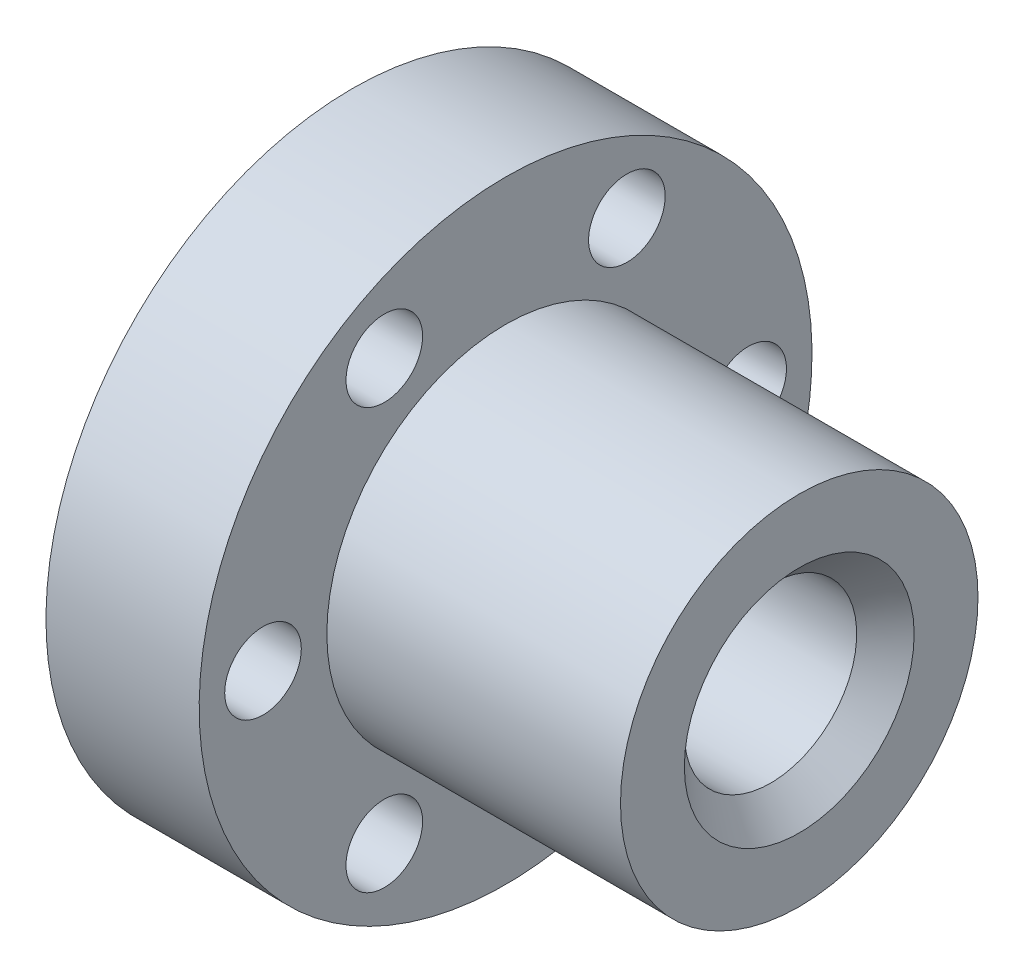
ISO-10303-21;
HEADER;
FILE_DESCRIPTION(('STEP AP214'),'2;1');
FILE_NAME('part.step','',(''),(''),'','','');
FILE_SCHEMA(('AUTOMOTIVE_DESIGN { 1 0 10303 214 1 1 1 1 }'));
ENDSEC;
DATA;
#1=APPLICATION_CONTEXT('core data for automotive mechanical design processes');
#2=APPLICATION_PROTOCOL_DEFINITION('international standard','automotive_design',2000,#1);
#3=PRODUCT_CONTEXT('',#1,'mechanical');
#4=PRODUCT('Part','Part','',(#3));
#5=PRODUCT_RELATED_PRODUCT_CATEGORY('part','',(#4));
#6=PRODUCT_DEFINITION_FORMATION('','',#4);
#7=PRODUCT_DEFINITION_CONTEXT('part definition',#1,'design');
#8=PRODUCT_DEFINITION('design','',#6,#7);
#9=PRODUCT_DEFINITION_SHAPE('','',#8);
#10=(LENGTH_UNIT() NAMED_UNIT(*) SI_UNIT(.MILLI.,.METRE.));
#11=(NAMED_UNIT(*) PLANE_ANGLE_UNIT() SI_UNIT($,.RADIAN.));
#12=(NAMED_UNIT(*) SI_UNIT($,.STERADIAN.) SOLID_ANGLE_UNIT());
#13=UNCERTAINTY_MEASURE_WITH_UNIT(LENGTH_MEASURE(1.E-05),#10,'distance_accuracy_value','');
#14=(GEOMETRIC_REPRESENTATION_CONTEXT(3) GLOBAL_UNCERTAINTY_ASSIGNED_CONTEXT((#13)) GLOBAL_UNIT_ASSIGNED_CONTEXT((#10,
#11,#12)) REPRESENTATION_CONTEXT('',''));
#15=CARTESIAN_POINT('',(0.,0.,0.));
#16=DIRECTION('',(0.,0.,1.));
#17=DIRECTION('',(1.,0.,0.));
#18=AXIS2_PLACEMENT_3D('',#15,#16,#17);
#19=CARTESIAN_POINT('',(23.,0.,0.));
#20=DIRECTION('',(1.,0.,0.));
#21=DIRECTION('',(0.,0.,-1.));
#22=AXIS2_PLACEMENT_3D('',#19,#20,#21);
#23=PLANE('',#22);
#24=CARTESIAN_POINT('',(23.,0.,0.));
#25=DIRECTION('',(-1.,0.,0.));
#26=DIRECTION('',(0.,-1.,0.));
#27=AXIS2_PLACEMENT_3D('',#24,#25,#26);
#28=CIRCLE('',#27,14.);
#29=CARTESIAN_POINT('',(23.,-14.,0.));
#30=VERTEX_POINT('',#29);
#31=EDGE_CURVE('E23',#30,#30,#28,.T.);
#32=ORIENTED_EDGE('',*,*,#31,.F.);
#33=EDGE_LOOP('',(#32));
#34=FACE_BOUND('',#33,.T.);
#35=CARTESIAN_POINT('',(23.,0.,0.));
#36=DIRECTION('',(-1.,0.,0.));
#37=DIRECTION('',(0.,0.,1.));
#38=AXIS2_PLACEMENT_3D('',#35,#36,#37);
#39=CIRCLE('',#38,9.);
#40=CARTESIAN_POINT('',(23.,0.,9.00000000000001));
#41=VERTEX_POINT('',#40);
#42=EDGE_CURVE('E76',#41,#41,#39,.T.);
#43=ORIENTED_EDGE('',*,*,#42,.T.);
#44=EDGE_LOOP('',(#43));
#45=FACE_BOUND('',#44,.T.);
#46=ADVANCED_FACE('F14',(#34,#45),#23,.T.);
#47=CARTESIAN_POINT('',(-12.,0.,0.));
#48=DIRECTION('',(-1.,0.,0.));
#49=DIRECTION('',(0.,0.,1.));
#50=AXIS2_PLACEMENT_3D('',#47,#48,#49);
#51=PLANE('',#50);
#52=CARTESIAN_POINT('',(-12.,0.,0.));
#53=DIRECTION('',(1.,0.,0.));
#54=DIRECTION('',(0.,1.,0.));
#55=AXIS2_PLACEMENT_3D('',#52,#53,#54);
#56=CIRCLE('',#55,24.);
#57=CARTESIAN_POINT('',(-12.,24.,0.));
#58=VERTEX_POINT('',#57);
#59=EDGE_CURVE('E33',#58,#58,#56,.T.);
#60=ORIENTED_EDGE('',*,*,#59,.F.);
#61=EDGE_LOOP('',(#60));
#62=FACE_BOUND('',#61,.T.);
#63=CARTESIAN_POINT('',(-11.9999999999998,0.,19.));
#64=DIRECTION('',(-1.,0.,0.));
#65=DIRECTION('',(0.,0.,1.));
#66=AXIS2_PLACEMENT_3D('',#63,#64,#65);
#67=CIRCLE('',#66,3.);
#68=CARTESIAN_POINT('',(-11.9999999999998,0.,22.));
#69=VERTEX_POINT('',#68);
#70=EDGE_CURVE('E41',#69,#69,#67,.T.);
#71=ORIENTED_EDGE('',*,*,#70,.F.);
#72=EDGE_LOOP('',(#71));
#73=FACE_BOUND('',#72,.T.);
#74=CARTESIAN_POINT('',(-11.9999999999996,-16.4544826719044,9.50000000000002));
#75=DIRECTION('',(-1.,0.,0.));
#76=DIRECTION('',(0.,0.,1.));
#77=AXIS2_PLACEMENT_3D('',#74,#75,#76);
#78=CIRCLE('',#77,3.);
#79=CARTESIAN_POINT('',(-11.9999999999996,-16.4544826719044,12.5));
#80=VERTEX_POINT('',#79);
#81=EDGE_CURVE('E42',#80,#80,#78,.T.);
#82=ORIENTED_EDGE('',*,*,#81,.F.);
#83=EDGE_LOOP('',(#82));
#84=FACE_BOUND('',#83,.T.);
#85=CARTESIAN_POINT('',(-11.9999999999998,-16.4544826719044,-9.50000000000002));
#86=DIRECTION('',(-1.,0.,0.));
#87=DIRECTION('',(0.,0.,1.));
#88=AXIS2_PLACEMENT_3D('',#85,#86,#87);
#89=CIRCLE('',#88,3.);
#90=CARTESIAN_POINT('',(-11.9999999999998,-16.4544826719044,-6.50000000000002));
#91=VERTEX_POINT('',#90);
#92=EDGE_CURVE('E47',#91,#91,#89,.T.);
#93=ORIENTED_EDGE('',*,*,#92,.F.);
#94=EDGE_LOOP('',(#93));
#95=FACE_BOUND('',#94,.T.);
#96=CARTESIAN_POINT('',(-12.,0.,-19.));
#97=DIRECTION('',(-1.,0.,0.));
#98=DIRECTION('',(0.,0.,1.));
#99=AXIS2_PLACEMENT_3D('',#96,#97,#98);
#100=CIRCLE('',#99,3.);
#101=CARTESIAN_POINT('',(-12.,0.,-16.));
#102=VERTEX_POINT('',#101);
#103=EDGE_CURVE('E52',#102,#102,#100,.T.);
#104=ORIENTED_EDGE('',*,*,#103,.F.);
#105=EDGE_LOOP('',(#104));
#106=FACE_BOUND('',#105,.T.);
#107=CARTESIAN_POINT('',(-12.,16.4544826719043,-9.50000000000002));
#108=DIRECTION('',(-1.,0.,0.));
#109=DIRECTION('',(0.,0.,1.));
#110=AXIS2_PLACEMENT_3D('',#107,#108,#109);
#111=CIRCLE('',#110,3.);
#112=CARTESIAN_POINT('',(-12.,16.4544826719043,-6.50000000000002));
#113=VERTEX_POINT('',#112);
#114=EDGE_CURVE('E56',#113,#113,#111,.T.);
#115=ORIENTED_EDGE('',*,*,#114,.F.);
#116=EDGE_LOOP('',(#115));
#117=FACE_BOUND('',#116,.T.);
#118=CARTESIAN_POINT('',(-11.9999999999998,16.4544826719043,9.50000000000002));
#119=DIRECTION('',(-1.,0.,0.));
#120=DIRECTION('',(0.,0.,1.));
#121=AXIS2_PLACEMENT_3D('',#118,#119,#120);
#122=CIRCLE('',#121,3.);
#123=CARTESIAN_POINT('',(-11.9999999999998,16.4544826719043,12.5));
#124=VERTEX_POINT('',#123);
#125=EDGE_CURVE('E60',#124,#124,#122,.T.);
#126=ORIENTED_EDGE('',*,*,#125,.F.);
#127=EDGE_LOOP('',(#126));
#128=FACE_BOUND('',#127,.T.);
#129=CARTESIAN_POINT('',(-12.,0.,0.));
#130=DIRECTION('',(-1.,0.,0.));
#131=DIRECTION('',(0.,0.,1.));
#132=AXIS2_PLACEMENT_3D('',#129,#130,#131);
#133=CIRCLE('',#132,9.);
#134=CARTESIAN_POINT('',(-12.,0.,9.00000000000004));
#135=VERTEX_POINT('',#134);
#136=EDGE_CURVE('E121',#135,#135,#133,.T.);
#137=ORIENTED_EDGE('',*,*,#136,.F.);
#138=EDGE_LOOP('',(#137));
#139=FACE_BOUND('',#138,.T.);
#140=ADVANCED_FACE('F104',(#62,#73,#84,#95,#106,#117,#128,#139),#51,.T.);
#141=CARTESIAN_POINT('',(-1.,0.,0.));
#142=DIRECTION('',(1.,0.,0.));
#143=DIRECTION('',(0.,-1.,0.));
#144=AXIS2_PLACEMENT_3D('',#141,#142,#143);
#145=CYLINDRICAL_SURFACE('',#144,14.);
#146=CARTESIAN_POINT('',(0.,0.,0.));
#147=DIRECTION('',(1.,0.,0.));
#148=DIRECTION('',(0.,0.,-1.));
#149=AXIS2_PLACEMENT_3D('',#146,#147,#148);
#150=CIRCLE('',#149,14.);
#151=CARTESIAN_POINT('',(0.,0.,-14.));
#152=VERTEX_POINT('',#151);
#153=EDGE_CURVE('E10',#152,#152,#150,.F.);
#154=ORIENTED_EDGE('',*,*,#153,.F.);
#155=EDGE_LOOP('',(#154));
#156=FACE_BOUND('',#155,.T.);
#157=ORIENTED_EDGE('',*,*,#31,.T.);
#158=EDGE_LOOP('',(#157));
#159=FACE_BOUND('',#158,.T.);
#160=ADVANCED_FACE('F16',(#156,#159),#145,.T.);
#161=CARTESIAN_POINT('',(0.,0.,0.));
#162=DIRECTION('',(1.,0.,0.));
#163=DIRECTION('',(0.,0.,-1.));
#164=AXIS2_PLACEMENT_3D('',#161,#162,#163);
#165=PLANE('',#164);
#166=CARTESIAN_POINT('',(2.22044604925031E-13,16.4544826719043,9.50000000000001));
#167=DIRECTION('',(1.,0.,0.));
#168=DIRECTION('',(0.,0.,-1.));
#169=AXIS2_PLACEMENT_3D('',#166,#167,#168);
#170=CIRCLE('',#169,3.);
#171=CARTESIAN_POINT('',(2.22044604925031E-13,16.4544826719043,6.50000000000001));
#172=VERTEX_POINT('',#171);
#173=EDGE_CURVE('E18',#172,#172,#170,.T.);
#174=ORIENTED_EDGE('',*,*,#173,.F.);
#175=EDGE_LOOP('',(#174));
#176=FACE_BOUND('',#175,.T.);
#177=CARTESIAN_POINT('',(0.,16.4544826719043,-9.50000000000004));
#178=DIRECTION('',(1.,0.,0.));
#179=DIRECTION('',(0.,0.,-1.));
#180=AXIS2_PLACEMENT_3D('',#177,#178,#179);
#181=CIRCLE('',#180,3.);
#182=CARTESIAN_POINT('',(0.,16.4544826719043,-12.5));
#183=VERTEX_POINT('',#182);
#184=EDGE_CURVE('E57',#183,#183,#181,.T.);
#185=ORIENTED_EDGE('',*,*,#184,.F.);
#186=EDGE_LOOP('',(#185));
#187=FACE_BOUND('',#186,.T.);
#188=CARTESIAN_POINT('',(0.,0.,-19.));
#189=DIRECTION('',(1.,0.,0.));
#190=DIRECTION('',(0.,0.,-1.));
#191=AXIS2_PLACEMENT_3D('',#188,#189,#190);
#192=CIRCLE('',#191,3.);
#193=CARTESIAN_POINT('',(0.,0.,-22.));
#194=VERTEX_POINT('',#193);
#195=EDGE_CURVE('E53',#194,#194,#192,.T.);
#196=ORIENTED_EDGE('',*,*,#195,.F.);
#197=EDGE_LOOP('',(#196));
#198=FACE_BOUND('',#197,.T.);
#199=CARTESIAN_POINT('',(2.22044604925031E-13,-16.4544826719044,-9.50000000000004));
#200=DIRECTION('',(1.,0.,0.));
#201=DIRECTION('',(0.,0.,-1.));
#202=AXIS2_PLACEMENT_3D('',#199,#200,#201);
#203=CIRCLE('',#202,3.);
#204=CARTESIAN_POINT('',(2.22044604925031E-13,-16.4544826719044,-12.5));
#205=VERTEX_POINT('',#204);
#206=EDGE_CURVE('E48',#205,#205,#203,.T.);
#207=ORIENTED_EDGE('',*,*,#206,.F.);
#208=EDGE_LOOP('',(#207));
#209=FACE_BOUND('',#208,.T.);
#210=CARTESIAN_POINT('',(4.44089209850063E-13,-16.4544826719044,9.50000000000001));
#211=DIRECTION('',(1.,0.,0.));
#212=DIRECTION('',(0.,0.,-1.));
#213=AXIS2_PLACEMENT_3D('',#210,#211,#212);
#214=CIRCLE('',#213,3.);
#215=CARTESIAN_POINT('',(4.44089209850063E-13,-16.4544826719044,6.50000000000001));
#216=VERTEX_POINT('',#215);
#217=EDGE_CURVE('E43',#216,#216,#214,.T.);
#218=ORIENTED_EDGE('',*,*,#217,.F.);
#219=EDGE_LOOP('',(#218));
#220=FACE_BOUND('',#219,.T.);
#221=CARTESIAN_POINT('',(2.22044604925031E-13,0.,19.));
#222=DIRECTION('',(1.,0.,0.));
#223=DIRECTION('',(0.,0.,-1.));
#224=AXIS2_PLACEMENT_3D('',#221,#222,#223);
#225=CIRCLE('',#224,3.);
#226=CARTESIAN_POINT('',(2.22044604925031E-13,0.,16.));
#227=VERTEX_POINT('',#226);
#228=EDGE_CURVE('E37',#227,#227,#225,.T.);
#229=ORIENTED_EDGE('',*,*,#228,.F.);
#230=EDGE_LOOP('',(#229));
#231=FACE_BOUND('',#230,.T.);
#232=ORIENTED_EDGE('',*,*,#153,.T.);
#233=EDGE_LOOP('',(#232));
#234=FACE_BOUND('',#233,.T.);
#235=CARTESIAN_POINT('',(0.,0.,0.));
#236=DIRECTION('',(-1.,0.,0.));
#237=DIRECTION('',(0.,1.,0.));
#238=AXIS2_PLACEMENT_3D('',#235,#236,#237);
#239=CIRCLE('',#238,24.);
#240=CARTESIAN_POINT('',(0.,24.,0.));
#241=VERTEX_POINT('',#240);
#242=EDGE_CURVE('E92',#241,#241,#239,.T.);
#243=ORIENTED_EDGE('',*,*,#242,.F.);
#244=EDGE_LOOP('',(#243));
#245=FACE_BOUND('',#244,.T.);
#246=ADVANCED_FACE('F166',(#176,#187,#198,#209,#220,#231,#234,#245),#165,.T.);
#247=CARTESIAN_POINT('',(0.,0.,0.));
#248=DIRECTION('',(-1.,0.,0.));
#249=DIRECTION('',(0.,1.,0.));
#250=AXIS2_PLACEMENT_3D('',#247,#248,#249);
#251=CYLINDRICAL_SURFACE('',#250,24.);
#252=ORIENTED_EDGE('',*,*,#59,.T.);
#253=EDGE_LOOP('',(#252));
#254=FACE_BOUND('',#253,.T.);
#255=ORIENTED_EDGE('',*,*,#242,.T.);
#256=EDGE_LOOP('',(#255));
#257=FACE_BOUND('',#256,.T.);
#258=ADVANCED_FACE('F101',(#254,#257),#251,.T.);
#259=CARTESIAN_POINT('',(1.00000000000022,0.,19.));
#260=DIRECTION('',(-1.,0.,0.));
#261=DIRECTION('',(0.,1.,0.));
#262=AXIS2_PLACEMENT_3D('',#259,#260,#261);
#263=CYLINDRICAL_SURFACE('',#262,3.);
#264=ORIENTED_EDGE('',*,*,#70,.T.);
#265=EDGE_LOOP('',(#264));
#266=FACE_BOUND('',#265,.T.);
#267=ORIENTED_EDGE('',*,*,#228,.T.);
#268=EDGE_LOOP('',(#267));
#269=FACE_BOUND('',#268,.T.);
#270=ADVANCED_FACE('F165',(#266,#269),#263,.F.);
#271=CARTESIAN_POINT('',(1.00000000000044,-16.4544826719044,9.50000000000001));
#272=DIRECTION('',(-1.,0.,0.));
#273=DIRECTION('',(0.,0.5,0.86602540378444));
#274=AXIS2_PLACEMENT_3D('',#271,#272,#273);
#275=CYLINDRICAL_SURFACE('',#274,3.);
#276=ORIENTED_EDGE('',*,*,#81,.T.);
#277=EDGE_LOOP('',(#276));
#278=FACE_BOUND('',#277,.T.);
#279=ORIENTED_EDGE('',*,*,#217,.T.);
#280=EDGE_LOOP('',(#279));
#281=FACE_BOUND('',#280,.T.);
#282=ADVANCED_FACE('F173',(#278,#281),#275,.F.);
#283=CARTESIAN_POINT('',(1.00000000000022,-16.4544826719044,-9.50000000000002));
#284=DIRECTION('',(-1.,0.,0.));
#285=DIRECTION('',(0.,-0.5,0.86602540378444));
#286=AXIS2_PLACEMENT_3D('',#283,#284,#285);
#287=CYLINDRICAL_SURFACE('',#286,3.);
#288=ORIENTED_EDGE('',*,*,#92,.T.);
#289=EDGE_LOOP('',(#288));
#290=FACE_BOUND('',#289,.T.);
#291=ORIENTED_EDGE('',*,*,#206,.T.);
#292=EDGE_LOOP('',(#291));
#293=FACE_BOUND('',#292,.T.);
#294=ADVANCED_FACE('F177',(#290,#293),#287,.F.);
#295=CARTESIAN_POINT('',(1.,0.,-19.));
#296=DIRECTION('',(-1.,0.,0.));
#297=DIRECTION('',(0.,-1.,0.));
#298=AXIS2_PLACEMENT_3D('',#295,#296,#297);
#299=CYLINDRICAL_SURFACE('',#298,3.);
#300=ORIENTED_EDGE('',*,*,#103,.T.);
#301=EDGE_LOOP('',(#300));
#302=FACE_BOUND('',#301,.T.);
#303=ORIENTED_EDGE('',*,*,#195,.T.);
#304=EDGE_LOOP('',(#303));
#305=FACE_BOUND('',#304,.T.);
#306=ADVANCED_FACE('F181',(#302,#305),#299,.F.);
#307=CARTESIAN_POINT('',(1.,16.4544826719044,-9.50000000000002));
#308=DIRECTION('',(-1.,0.,0.));
#309=DIRECTION('',(0.,-0.5,-0.866025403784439));
#310=AXIS2_PLACEMENT_3D('',#307,#308,#309);
#311=CYLINDRICAL_SURFACE('',#310,3.);
#312=ORIENTED_EDGE('',*,*,#114,.T.);
#313=EDGE_LOOP('',(#312));
#314=FACE_BOUND('',#313,.T.);
#315=ORIENTED_EDGE('',*,*,#184,.T.);
#316=EDGE_LOOP('',(#315));
#317=FACE_BOUND('',#316,.T.);
#318=ADVANCED_FACE('F156',(#314,#317),#311,.F.);
#319=CARTESIAN_POINT('',(1.00000000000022,16.4544826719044,9.50000000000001));
#320=DIRECTION('',(-1.,0.,0.));
#321=DIRECTION('',(0.,0.5,-0.86602540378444));
#322=AXIS2_PLACEMENT_3D('',#319,#320,#321);
#323=CYLINDRICAL_SURFACE('',#322,3.);
#324=ORIENTED_EDGE('',*,*,#125,.T.);
#325=EDGE_LOOP('',(#324));
#326=FACE_BOUND('',#325,.T.);
#327=ORIENTED_EDGE('',*,*,#173,.T.);
#328=EDGE_LOOP('',(#327));
#329=FACE_BOUND('',#328,.T.);
#330=ADVANCED_FACE('F146',(#326,#329),#323,.F.);
#331=CARTESIAN_POINT('',(23.,0.,0.));
#332=DIRECTION('',(1.,0.,0.));
#333=DIRECTION('',(0.,0.,-1.));
#334=AXIS2_PLACEMENT_3D('',#331,#332,#333);
#335=CONICAL_SURFACE('',#334,9.,0.785398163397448);
#336=CARTESIAN_POINT('',(20.75,0.,0.));
#337=DIRECTION('',(-1.,0.,0.));
#338=DIRECTION('',(0.,0.,1.));
#339=AXIS2_PLACEMENT_3D('',#336,#337,#338);
#340=CIRCLE('',#339,6.75);
#341=CARTESIAN_POINT('',(20.75,0.,6.75000000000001));
#342=VERTEX_POINT('',#341);
#343=EDGE_CURVE('E128',#342,#342,#340,.T.);
#344=ORIENTED_EDGE('',*,*,#343,.T.);
#345=EDGE_LOOP('',(#344));
#346=FACE_BOUND('',#345,.T.);
#347=ORIENTED_EDGE('',*,*,#42,.F.);
#348=EDGE_LOOP('',(#347));
#349=FACE_BOUND('',#348,.T.);
#350=ADVANCED_FACE('F143',(#346,#349),#335,.F.);
#351=CARTESIAN_POINT('',(-13.,0.,0.));
#352=DIRECTION('',(-1.,0.,0.));
#353=DIRECTION('',(0.,0.,1.));
#354=AXIS2_PLACEMENT_3D('',#351,#352,#353);
#355=CYLINDRICAL_SURFACE('',#354,6.75);
#356=CARTESIAN_POINT('',(-9.75000000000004,0.,0.));
#357=DIRECTION('',(-1.,0.,0.));
#358=DIRECTION('',(0.,0.,1.));
#359=AXIS2_PLACEMENT_3D('',#356,#357,#358);
#360=CIRCLE('',#359,6.75);
#361=CARTESIAN_POINT('',(-9.75000000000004,0.,6.75000000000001));
#362=VERTEX_POINT('',#361);
#363=EDGE_CURVE('E123',#362,#362,#360,.T.);
#364=ORIENTED_EDGE('',*,*,#363,.T.);
#365=EDGE_LOOP('',(#364));
#366=FACE_BOUND('',#365,.T.);
#367=ORIENTED_EDGE('',*,*,#343,.F.);
#368=EDGE_LOOP('',(#367));
#369=FACE_BOUND('',#368,.T.);
#370=ADVANCED_FACE('F145',(#366,#369),#355,.F.);
#371=CARTESIAN_POINT('',(-9.75000000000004,0.,0.));
#372=DIRECTION('',(-1.,0.,0.));
#373=DIRECTION('',(0.,0.,1.));
#374=AXIS2_PLACEMENT_3D('',#371,#372,#373);
#375=CONICAL_SURFACE('',#374,6.75,0.785398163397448);
#376=ORIENTED_EDGE('',*,*,#136,.T.);
#377=EDGE_LOOP('',(#376));
#378=FACE_BOUND('',#377,.T.);
#379=ORIENTED_EDGE('',*,*,#363,.F.);
#380=EDGE_LOOP('',(#379));
#381=FACE_BOUND('',#380,.T.);
#382=ADVANCED_FACE('F153',(#378,#381),#375,.F.);
#383=CLOSED_SHELL('',(#46,#140,#160,#246,#258,#270,#282,#294,#306,#318,#330,#350,#370,#382));
#384=MANIFOLD_SOLID_BREP('B1',#383);
#385=ADVANCED_BREP_SHAPE_REPRESENTATION('',(#18,#384),#14);
#386=SHAPE_DEFINITION_REPRESENTATION(#9,#385);
ENDSEC;
END-ISO-10303-21;
